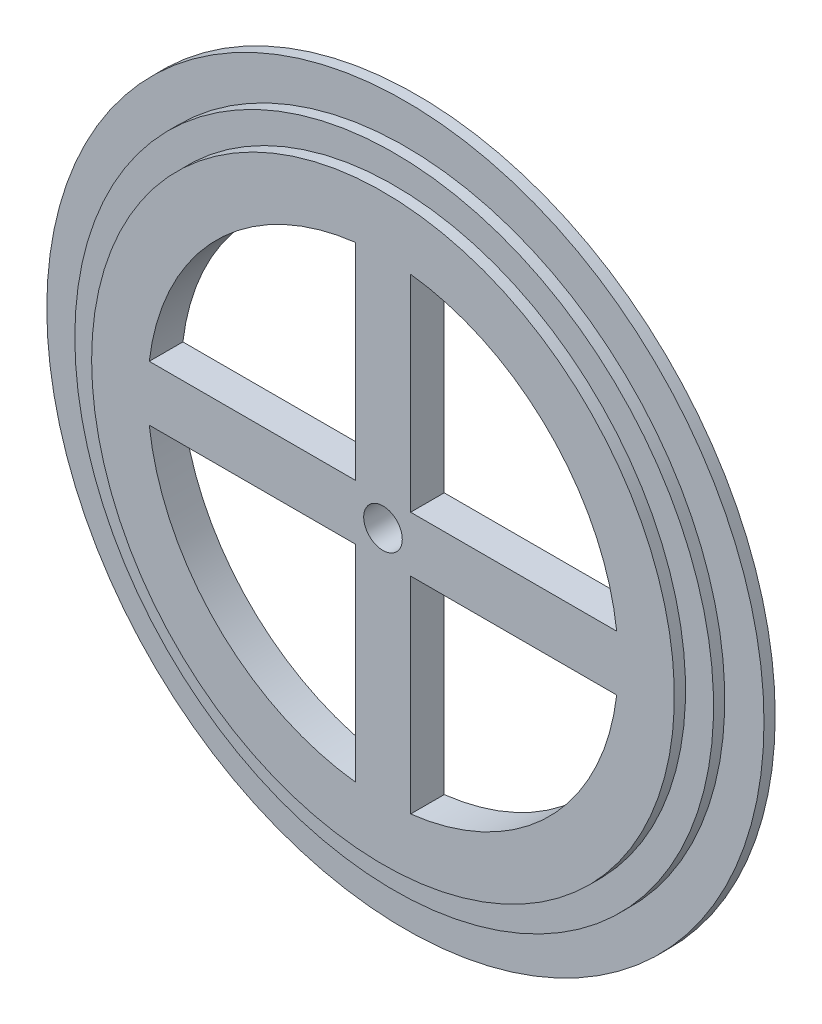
ISO-10303-21;
HEADER;
FILE_DESCRIPTION(('STEP AP214'),'2;1');
FILE_NAME('part.step','',(''),(''),'','','');
FILE_SCHEMA(('AUTOMOTIVE_DESIGN { 1 0 10303 214 1 1 1 1 }'));
ENDSEC;
DATA;
#1=APPLICATION_CONTEXT('core data for automotive mechanical design processes');
#2=APPLICATION_PROTOCOL_DEFINITION('international standard','automotive_design',2000,#1);
#3=PRODUCT_CONTEXT('',#1,'mechanical');
#4=PRODUCT('Part','Part','',(#3));
#5=PRODUCT_RELATED_PRODUCT_CATEGORY('part','',(#4));
#6=PRODUCT_DEFINITION_FORMATION('','',#4);
#7=PRODUCT_DEFINITION_CONTEXT('part definition',#1,'design');
#8=PRODUCT_DEFINITION('design','',#6,#7);
#9=PRODUCT_DEFINITION_SHAPE('','',#8);
#10=(LENGTH_UNIT() NAMED_UNIT(*) SI_UNIT(.MILLI.,.METRE.));
#11=(NAMED_UNIT(*) PLANE_ANGLE_UNIT() SI_UNIT($,.RADIAN.));
#12=(NAMED_UNIT(*) SI_UNIT($,.STERADIAN.) SOLID_ANGLE_UNIT());
#13=UNCERTAINTY_MEASURE_WITH_UNIT(LENGTH_MEASURE(1.E-05),#10,'distance_accuracy_value','');
#14=(GEOMETRIC_REPRESENTATION_CONTEXT(3) GLOBAL_UNCERTAINTY_ASSIGNED_CONTEXT((#13)) GLOBAL_UNIT_ASSIGNED_CONTEXT((#10,
#11,#12)) REPRESENTATION_CONTEXT('',''));
#15=CARTESIAN_POINT('',(0.,0.,0.));
#16=DIRECTION('',(0.,0.,1.));
#17=DIRECTION('',(1.,0.,0.));
#18=AXIS2_PLACEMENT_3D('',#15,#16,#17);
#19=CARTESIAN_POINT('',(0.,0.,0.));
#20=DIRECTION('',(0.,0.,1.));
#21=DIRECTION('',(1.,0.,0.));
#22=AXIS2_PLACEMENT_3D('',#19,#20,#21);
#23=PLANE('',#22);
#24=CARTESIAN_POINT('',(0.,0.,0.));
#25=DIRECTION('',(0.,0.,1.));
#26=DIRECTION('',(1.,0.,0.));
#27=AXIS2_PLACEMENT_3D('',#24,#25,#26);
#28=CIRCLE('',#27,5.46570251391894);
#29=CARTESIAN_POINT('',(5.46570251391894,0.,0.));
#30=VERTEX_POINT('',#29);
#31=EDGE_CURVE('E205',#30,#30,#28,.T.);
#32=ORIENTED_EDGE('',*,*,#31,.F.);
#33=EDGE_LOOP('',(#32));
#34=FACE_BOUND('',#33,.T.);
#35=DIRECTION('',(-1.,0.,0.));
#36=VECTOR('',#35,1.);
#37=CARTESIAN_POINT('',(0.,-7.82986361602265,0.));
#38=LINE('',#37,#36);
#39=CARTESIAN_POINT('',(-7.82986361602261,-7.82986361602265,0.));
#40=VERTEX_POINT('',#39);
#41=CARTESIAN_POINT('',(-66.2136606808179,-7.82986361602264,0.));
#42=VERTEX_POINT('',#41);
#43=EDGE_CURVE('E49',#40,#42,#38,.T.);
#44=ORIENTED_EDGE('',*,*,#43,.F.);
#45=DIRECTION('',(0.,1.,0.));
#46=VECTOR('',#45,1.);
#47=CARTESIAN_POINT('',(-7.82986361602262,0.,0.));
#48=LINE('',#47,#46);
#49=CARTESIAN_POINT('',(-7.8298636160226,-66.2136606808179,0.));
#50=VERTEX_POINT('',#49);
#51=EDGE_CURVE('E185',#50,#40,#48,.T.);
#52=ORIENTED_EDGE('',*,*,#51,.F.);
#53=CARTESIAN_POINT('',(0.,0.,0.));
#54=DIRECTION('',(0.,0.,1.));
#55=DIRECTION('',(1.,0.,0.));
#56=AXIS2_PLACEMENT_3D('',#53,#54,#55);
#57=CIRCLE('',#56,66.675);
#58=EDGE_CURVE('E193',#42,#50,#57,.T.);
#59=ORIENTED_EDGE('',*,*,#58,.F.);
#60=EDGE_LOOP('',(#44,#52,#59));
#61=FACE_BOUND('',#60,.T.);
#62=DIRECTION('',(0.,-1.,0.));
#63=VECTOR('',#62,1.);
#64=CARTESIAN_POINT('',(7.82986361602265,0.,0.));
#65=LINE('',#64,#63);
#66=CARTESIAN_POINT('',(7.82986361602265,-7.82986361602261,0.));
#67=VERTEX_POINT('',#66);
#68=CARTESIAN_POINT('',(7.82986361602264,-66.2136606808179,0.));
#69=VERTEX_POINT('',#68);
#70=EDGE_CURVE('E57',#67,#69,#65,.T.);
#71=ORIENTED_EDGE('',*,*,#70,.F.);
#72=DIRECTION('',(-1.,0.,0.));
#73=VECTOR('',#72,1.);
#74=CARTESIAN_POINT('',(0.,-7.82986361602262,0.));
#75=LINE('',#74,#73);
#76=CARTESIAN_POINT('',(66.2136606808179,-7.82986361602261,0.));
#77=VERTEX_POINT('',#76);
#78=EDGE_CURVE('E163',#77,#67,#75,.T.);
#79=ORIENTED_EDGE('',*,*,#78,.F.);
#80=CARTESIAN_POINT('',(0.,0.,0.));
#81=DIRECTION('',(0.,0.,1.));
#82=DIRECTION('',(1.,0.,0.));
#83=AXIS2_PLACEMENT_3D('',#80,#81,#82);
#84=CIRCLE('',#83,66.675);
#85=EDGE_CURVE('E171',#69,#77,#84,.T.);
#86=ORIENTED_EDGE('',*,*,#85,.F.);
#87=EDGE_LOOP('',(#71,#79,#86));
#88=FACE_BOUND('',#87,.T.);
#89=DIRECTION('',(1.,0.,0.));
#90=VECTOR('',#89,1.);
#91=CARTESIAN_POINT('',(0.,7.82986361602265,0.));
#92=LINE('',#91,#90);
#93=CARTESIAN_POINT('',(7.82986361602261,7.82986361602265,0.));
#94=VERTEX_POINT('',#93);
#95=CARTESIAN_POINT('',(66.2136606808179,7.82986361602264,0.));
#96=VERTEX_POINT('',#95);
#97=EDGE_CURVE('E130',#94,#96,#92,.T.);
#98=ORIENTED_EDGE('',*,*,#97,.F.);
#99=DIRECTION('',(0.,-1.,0.));
#100=VECTOR('',#99,1.);
#101=CARTESIAN_POINT('',(7.82986361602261,0.,0.));
#102=LINE('',#101,#100);
#103=CARTESIAN_POINT('',(7.82986361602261,66.2136606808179,0.));
#104=VERTEX_POINT('',#103);
#105=EDGE_CURVE('E145',#104,#94,#102,.T.);
#106=ORIENTED_EDGE('',*,*,#105,.F.);
#107=CARTESIAN_POINT('',(0.,0.,0.));
#108=DIRECTION('',(0.,0.,1.));
#109=DIRECTION('',(1.,0.,0.));
#110=AXIS2_PLACEMENT_3D('',#107,#108,#109);
#111=CIRCLE('',#110,66.675);
#112=EDGE_CURVE('E148',#96,#104,#111,.T.);
#113=ORIENTED_EDGE('',*,*,#112,.F.);
#114=EDGE_LOOP('',(#98,#106,#113));
#115=FACE_BOUND('',#114,.T.);
#116=DIRECTION('',(0.,1.,0.));
#117=VECTOR('',#116,1.);
#118=CARTESIAN_POINT('',(-7.82986361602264,0.,0.));
#119=LINE('',#118,#117);
#120=CARTESIAN_POINT('',(-7.82986361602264,7.82986361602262,0.));
#121=VERTEX_POINT('',#120);
#122=CARTESIAN_POINT('',(-7.82986361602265,66.2136606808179,0.));
#123=VERTEX_POINT('',#122);
#124=EDGE_CURVE('E157',#121,#123,#119,.T.);
#125=ORIENTED_EDGE('',*,*,#124,.F.);
#126=DIRECTION('',(1.,0.,0.));
#127=VECTOR('',#126,1.);
#128=CARTESIAN_POINT('',(0.,7.82986361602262,0.));
#129=LINE('',#128,#127);
#130=CARTESIAN_POINT('',(-66.2136606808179,7.8298636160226,0.));
#131=VERTEX_POINT('',#130);
#132=EDGE_CURVE('E212',#131,#121,#129,.T.);
#133=ORIENTED_EDGE('',*,*,#132,.F.);
#134=CARTESIAN_POINT('',(0.,0.,0.));
#135=DIRECTION('',(0.,0.,1.));
#136=DIRECTION('',(1.,0.,0.));
#137=AXIS2_PLACEMENT_3D('',#134,#135,#136);
#138=CIRCLE('',#137,66.675);
#139=EDGE_CURVE('E220',#123,#131,#138,.T.);
#140=ORIENTED_EDGE('',*,*,#139,.F.);
#141=EDGE_LOOP('',(#125,#133,#140));
#142=FACE_BOUND('',#141,.T.);
#143=CARTESIAN_POINT('',(0.,0.,0.));
#144=DIRECTION('',(0.,0.,-1.));
#145=DIRECTION('',(-1.,0.,0.));
#146=AXIS2_PLACEMENT_3D('',#143,#144,#145);
#147=CIRCLE('',#146,82.55);
#148=CARTESIAN_POINT('',(-82.55,0.,0.));
#149=VERTEX_POINT('',#148);
#150=EDGE_CURVE('E11',#149,#149,#147,.T.);
#151=ORIENTED_EDGE('',*,*,#150,.F.);
#152=EDGE_LOOP('',(#151));
#153=FACE_BOUND('',#152,.T.);
#154=ADVANCED_FACE('F35',(#34,#61,#88,#115,#142,#153),#23,.T.);
#155=CARTESIAN_POINT('',(0.,0.,-9.52500000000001));
#156=DIRECTION('',(0.,0.,-1.));
#157=DIRECTION('',(-1.,0.,0.));
#158=AXIS2_PLACEMENT_3D('',#155,#156,#157);
#159=CYLINDRICAL_SURFACE('',#158,82.55);
#160=ORIENTED_EDGE('',*,*,#150,.T.);
#161=EDGE_LOOP('',(#160));
#162=FACE_BOUND('',#161,.T.);
#163=CARTESIAN_POINT('',(0.,0.,-3.175));
#164=DIRECTION('',(0.,0.,-1.));
#165=DIRECTION('',(-1.,0.,0.));
#166=AXIS2_PLACEMENT_3D('',#163,#164,#165);
#167=CIRCLE('',#166,82.55);
#168=CARTESIAN_POINT('',(-82.55,0.,-3.175));
#169=VERTEX_POINT('',#168);
#170=EDGE_CURVE('E42',#169,#169,#167,.T.);
#171=ORIENTED_EDGE('',*,*,#170,.F.);
#172=EDGE_LOOP('',(#171));
#173=FACE_BOUND('',#172,.T.);
#174=ADVANCED_FACE('F248',(#162,#173),#159,.T.);
#175=CARTESIAN_POINT('',(0.,82.55,-3.175));
#176=DIRECTION('',(0.,0.,1.));
#177=DIRECTION('',(1.,0.,0.));
#178=AXIS2_PLACEMENT_3D('',#175,#176,#177);
#179=PLANE('',#178);
#180=ORIENTED_EDGE('',*,*,#170,.T.);
#181=EDGE_LOOP('',(#180));
#182=FACE_BOUND('',#181,.T.);
#183=CARTESIAN_POINT('',(0.,0.,-3.175));
#184=DIRECTION('',(0.,0.,-1.));
#185=DIRECTION('',(-1.,0.,0.));
#186=AXIS2_PLACEMENT_3D('',#183,#184,#185);
#187=CIRCLE('',#186,90.4875);
#188=CARTESIAN_POINT('',(-90.4875,0.,-3.175));
#189=VERTEX_POINT('',#188);
#190=EDGE_CURVE('E240',#189,#189,#187,.T.);
#191=ORIENTED_EDGE('',*,*,#190,.F.);
#192=EDGE_LOOP('',(#191));
#193=FACE_BOUND('',#192,.T.);
#194=ADVANCED_FACE('F245',(#182,#193),#179,.T.);
#195=CARTESIAN_POINT('',(0.,0.,-9.52500000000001));
#196=DIRECTION('',(0.,0.,-1.));
#197=DIRECTION('',(-1.,0.,0.));
#198=AXIS2_PLACEMENT_3D('',#195,#196,#197);
#199=CYLINDRICAL_SURFACE('',#198,90.4875);
#200=ORIENTED_EDGE('',*,*,#190,.T.);
#201=EDGE_LOOP('',(#200));
#202=FACE_BOUND('',#201,.T.);
#203=CARTESIAN_POINT('',(0.,0.,-6.35));
#204=DIRECTION('',(0.,0.,-1.));
#205=DIRECTION('',(-1.,0.,0.));
#206=AXIS2_PLACEMENT_3D('',#203,#204,#205);
#207=CIRCLE('',#206,90.4875);
#208=CARTESIAN_POINT('',(-90.4875,0.,-6.35));
#209=VERTEX_POINT('',#208);
#210=EDGE_CURVE('E237',#209,#209,#207,.T.);
#211=ORIENTED_EDGE('',*,*,#210,.F.);
#212=EDGE_LOOP('',(#211));
#213=FACE_BOUND('',#212,.T.);
#214=ADVANCED_FACE('F255',(#202,#213),#199,.T.);
#215=CARTESIAN_POINT('',(0.,90.4875,-6.35));
#216=DIRECTION('',(0.,0.,1.));
#217=DIRECTION('',(1.,0.,0.));
#218=AXIS2_PLACEMENT_3D('',#215,#216,#217);
#219=PLANE('',#218);
#220=ORIENTED_EDGE('',*,*,#210,.T.);
#221=EDGE_LOOP('',(#220));
#222=FACE_BOUND('',#221,.T.);
#223=CARTESIAN_POINT('',(0.,0.,-6.35));
#224=DIRECTION('',(0.,0.,-1.));
#225=DIRECTION('',(-1.,0.,0.));
#226=AXIS2_PLACEMENT_3D('',#223,#224,#225);
#227=CIRCLE('',#226,101.6);
#228=CARTESIAN_POINT('',(-101.6,0.,-6.35));
#229=VERTEX_POINT('',#228);
#230=EDGE_CURVE('E234',#229,#229,#227,.T.);
#231=ORIENTED_EDGE('',*,*,#230,.F.);
#232=EDGE_LOOP('',(#231));
#233=FACE_BOUND('',#232,.T.);
#234=ADVANCED_FACE('F261',(#222,#233),#219,.T.);
#235=CARTESIAN_POINT('',(0.,0.,-9.52500000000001));
#236=DIRECTION('',(0.,0.,-1.));
#237=DIRECTION('',(-1.,0.,0.));
#238=AXIS2_PLACEMENT_3D('',#235,#236,#237);
#239=CYLINDRICAL_SURFACE('',#238,101.6);
#240=ORIENTED_EDGE('',*,*,#230,.T.);
#241=EDGE_LOOP('',(#240));
#242=FACE_BOUND('',#241,.T.);
#243=CARTESIAN_POINT('',(0.,0.,-9.525));
#244=DIRECTION('',(0.,0.,-1.));
#245=DIRECTION('',(-1.,0.,0.));
#246=AXIS2_PLACEMENT_3D('',#243,#244,#245);
#247=CIRCLE('',#246,101.6);
#248=CARTESIAN_POINT('',(-101.6,0.,-9.525));
#249=VERTEX_POINT('',#248);
#250=EDGE_CURVE('E227',#249,#249,#247,.T.);
#251=ORIENTED_EDGE('',*,*,#250,.F.);
#252=EDGE_LOOP('',(#251));
#253=FACE_BOUND('',#252,.T.);
#254=ADVANCED_FACE('F265',(#242,#253),#239,.T.);
#255=CARTESIAN_POINT('',(0.,101.6,-9.525));
#256=DIRECTION('',(0.,0.,-1.));
#257=DIRECTION('',(-1.,0.,0.));
#258=AXIS2_PLACEMENT_3D('',#255,#256,#257);
#259=PLANE('',#258);
#260=CARTESIAN_POINT('',(0.,0.,-9.525));
#261=DIRECTION('',(0.,0.,1.));
#262=DIRECTION('',(1.,0.,0.));
#263=AXIS2_PLACEMENT_3D('',#260,#261,#262);
#264=CIRCLE('',#263,5.46570251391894);
#265=CARTESIAN_POINT('',(5.46570251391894,0.,-9.525));
#266=VERTEX_POINT('',#265);
#267=EDGE_CURVE('E194',#266,#266,#264,.T.);
#268=ORIENTED_EDGE('',*,*,#267,.T.);
#269=EDGE_LOOP('',(#268));
#270=FACE_BOUND('',#269,.T.);
#271=DIRECTION('',(-1.,0.,0.));
#272=VECTOR('',#271,1.);
#273=CARTESIAN_POINT('',(0.,-7.82986361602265,-9.525));
#274=LINE('',#273,#272);
#275=CARTESIAN_POINT('',(-7.82986361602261,-7.82986361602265,-9.525));
#276=VERTEX_POINT('',#275);
#277=CARTESIAN_POINT('',(-66.2136606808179,-7.82986361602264,-9.525));
#278=VERTEX_POINT('',#277);
#279=EDGE_CURVE('E181',#276,#278,#274,.T.);
#280=ORIENTED_EDGE('',*,*,#279,.T.);
#281=CARTESIAN_POINT('',(0.,0.,-9.525));
#282=DIRECTION('',(0.,0.,1.));
#283=DIRECTION('',(1.,0.,0.));
#284=AXIS2_PLACEMENT_3D('',#281,#282,#283);
#285=CIRCLE('',#284,66.675);
#286=CARTESIAN_POINT('',(-7.8298636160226,-66.2136606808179,-9.525));
#287=VERTEX_POINT('',#286);
#288=EDGE_CURVE('E184',#278,#287,#285,.T.);
#289=ORIENTED_EDGE('',*,*,#288,.T.);
#290=DIRECTION('',(0.,1.,0.));
#291=VECTOR('',#290,1.);
#292=CARTESIAN_POINT('',(-7.82986361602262,0.,-9.525));
#293=LINE('',#292,#291);
#294=EDGE_CURVE('E188',#287,#276,#293,.T.);
#295=ORIENTED_EDGE('',*,*,#294,.T.);
#296=EDGE_LOOP('',(#280,#289,#295));
#297=FACE_BOUND('',#296,.T.);
#298=DIRECTION('',(0.,-1.,0.));
#299=VECTOR('',#298,1.);
#300=CARTESIAN_POINT('',(7.82986361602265,0.,-9.525));
#301=LINE('',#300,#299);
#302=CARTESIAN_POINT('',(7.82986361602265,-7.82986361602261,-9.525));
#303=VERTEX_POINT('',#302);
#304=CARTESIAN_POINT('',(7.82986361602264,-66.2136606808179,-9.525));
#305=VERTEX_POINT('',#304);
#306=EDGE_CURVE('E159',#303,#305,#301,.T.);
#307=ORIENTED_EDGE('',*,*,#306,.T.);
#308=CARTESIAN_POINT('',(0.,0.,-9.525));
#309=DIRECTION('',(0.,0.,1.));
#310=DIRECTION('',(1.,0.,0.));
#311=AXIS2_PLACEMENT_3D('',#308,#309,#310);
#312=CIRCLE('',#311,66.675);
#313=CARTESIAN_POINT('',(66.2136606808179,-7.82986361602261,-9.525));
#314=VERTEX_POINT('',#313);
#315=EDGE_CURVE('E162',#305,#314,#312,.T.);
#316=ORIENTED_EDGE('',*,*,#315,.T.);
#317=DIRECTION('',(-1.,0.,0.));
#318=VECTOR('',#317,1.);
#319=CARTESIAN_POINT('',(0.,-7.82986361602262,-9.525));
#320=LINE('',#319,#318);
#321=EDGE_CURVE('E166',#314,#303,#320,.T.);
#322=ORIENTED_EDGE('',*,*,#321,.T.);
#323=EDGE_LOOP('',(#307,#316,#322));
#324=FACE_BOUND('',#323,.T.);
#325=DIRECTION('',(1.,0.,0.));
#326=VECTOR('',#325,1.);
#327=CARTESIAN_POINT('',(0.,7.82986361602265,-9.525));
#328=LINE('',#327,#326);
#329=CARTESIAN_POINT('',(7.82986361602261,7.82986361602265,-9.525));
#330=VERTEX_POINT('',#329);
#331=CARTESIAN_POINT('',(66.2136606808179,7.82986361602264,-9.525));
#332=VERTEX_POINT('',#331);
#333=EDGE_CURVE('E127',#330,#332,#328,.T.);
#334=ORIENTED_EDGE('',*,*,#333,.T.);
#335=CARTESIAN_POINT('',(0.,0.,-9.525));
#336=DIRECTION('',(0.,0.,1.));
#337=DIRECTION('',(1.,0.,0.));
#338=AXIS2_PLACEMENT_3D('',#335,#336,#337);
#339=CIRCLE('',#338,66.675);
#340=CARTESIAN_POINT('',(7.82986361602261,66.2136606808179,-9.525));
#341=VERTEX_POINT('',#340);
#342=EDGE_CURVE('E139',#332,#341,#339,.T.);
#343=ORIENTED_EDGE('',*,*,#342,.T.);
#344=DIRECTION('',(0.,-1.,0.));
#345=VECTOR('',#344,1.);
#346=CARTESIAN_POINT('',(7.82986361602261,0.,-9.525));
#347=LINE('',#346,#345);
#348=EDGE_CURVE('E135',#341,#330,#347,.T.);
#349=ORIENTED_EDGE('',*,*,#348,.T.);
#350=EDGE_LOOP('',(#334,#343,#349));
#351=FACE_BOUND('',#350,.T.);
#352=DIRECTION('',(0.,1.,0.));
#353=VECTOR('',#352,1.);
#354=CARTESIAN_POINT('',(-7.82986361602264,0.,-9.525));
#355=LINE('',#354,#353);
#356=CARTESIAN_POINT('',(-7.82986361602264,7.82986361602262,-9.525));
#357=VERTEX_POINT('',#356);
#358=CARTESIAN_POINT('',(-7.82986361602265,66.2136606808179,-9.525));
#359=VERTEX_POINT('',#358);
#360=EDGE_CURVE('E208',#357,#359,#355,.T.);
#361=ORIENTED_EDGE('',*,*,#360,.T.);
#362=CARTESIAN_POINT('',(0.,0.,-9.525));
#363=DIRECTION('',(0.,0.,1.));
#364=DIRECTION('',(1.,0.,0.));
#365=AXIS2_PLACEMENT_3D('',#362,#363,#364);
#366=CIRCLE('',#365,66.675);
#367=CARTESIAN_POINT('',(-66.2136606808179,7.8298636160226,-9.525));
#368=VERTEX_POINT('',#367);
#369=EDGE_CURVE('E211',#359,#368,#366,.T.);
#370=ORIENTED_EDGE('',*,*,#369,.T.);
#371=DIRECTION('',(1.,0.,0.));
#372=VECTOR('',#371,1.);
#373=CARTESIAN_POINT('',(0.,7.82986361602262,-9.525));
#374=LINE('',#373,#372);
#375=EDGE_CURVE('E215',#368,#357,#374,.T.);
#376=ORIENTED_EDGE('',*,*,#375,.T.);
#377=EDGE_LOOP('',(#361,#370,#376));
#378=FACE_BOUND('',#377,.T.);
#379=ORIENTED_EDGE('',*,*,#250,.T.);
#380=EDGE_LOOP('',(#379));
#381=FACE_BOUND('',#380,.T.);
#382=ADVANCED_FACE('F143',(#270,#297,#324,#351,#378,#381),#259,.T.);
#383=CARTESIAN_POINT('',(-7.82986361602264,0.,-9.525));
#384=DIRECTION('',(1.,0.,0.));
#385=DIRECTION('',(0.,1.,0.));
#386=AXIS2_PLACEMENT_3D('',#383,#384,#385);
#387=PLANE('',#386);
#388=ORIENTED_EDGE('',*,*,#124,.T.);
#389=DIRECTION('',(0.,0.,1.));
#390=VECTOR('',#389,1.);
#391=CARTESIAN_POINT('',(-7.82986361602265,66.2136606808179,-9.525));
#392=LINE('',#391,#390);
#393=EDGE_CURVE('E218',#359,#123,#392,.T.);
#394=ORIENTED_EDGE('',*,*,#393,.F.);
#395=ORIENTED_EDGE('',*,*,#360,.F.);
#396=DIRECTION('',(0.,0.,1.));
#397=VECTOR('',#396,1.);
#398=CARTESIAN_POINT('',(-7.82986361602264,7.82986361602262,-9.525));
#399=LINE('',#398,#397);
#400=EDGE_CURVE('E225',#357,#121,#399,.T.);
#401=ORIENTED_EDGE('',*,*,#400,.T.);
#402=EDGE_LOOP('',(#388,#394,#395,#401));
#403=FACE_BOUND('',#402,.T.);
#404=ADVANCED_FACE('F272',(#403),#387,.F.);
#405=CARTESIAN_POINT('',(0.,7.82986361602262,-9.525));
#406=DIRECTION('',(0.,-1.,0.));
#407=DIRECTION('',(1.,0.,0.));
#408=AXIS2_PLACEMENT_3D('',#405,#406,#407);
#409=PLANE('',#408);
#410=ORIENTED_EDGE('',*,*,#132,.T.);
#411=ORIENTED_EDGE('',*,*,#400,.F.);
#412=ORIENTED_EDGE('',*,*,#375,.F.);
#413=DIRECTION('',(0.,0.,1.));
#414=VECTOR('',#413,1.);
#415=CARTESIAN_POINT('',(-66.2136606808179,7.8298636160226,-9.525));
#416=LINE('',#415,#414);
#417=EDGE_CURVE('E228',#368,#131,#416,.T.);
#418=ORIENTED_EDGE('',*,*,#417,.T.);
#419=EDGE_LOOP('',(#410,#411,#412,#418));
#420=FACE_BOUND('',#419,.T.);
#421=ADVANCED_FACE('F276',(#420),#409,.F.);
#422=CARTESIAN_POINT('',(0.,0.,-9.525));
#423=DIRECTION('',(0.,0.,1.));
#424=DIRECTION('',(1.,0.,0.));
#425=AXIS2_PLACEMENT_3D('',#422,#423,#424);
#426=CYLINDRICAL_SURFACE('',#425,66.675);
#427=ORIENTED_EDGE('',*,*,#139,.T.);
#428=ORIENTED_EDGE('',*,*,#417,.F.);
#429=ORIENTED_EDGE('',*,*,#369,.F.);
#430=ORIENTED_EDGE('',*,*,#393,.T.);
#431=EDGE_LOOP('',(#427,#428,#429,#430));
#432=FACE_BOUND('',#431,.T.);
#433=ADVANCED_FACE('F278',(#432),#426,.F.);
#434=CARTESIAN_POINT('',(0.,7.82986361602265,-9.525));
#435=DIRECTION('',(0.,-1.,0.));
#436=DIRECTION('',(1.,0.,0.));
#437=AXIS2_PLACEMENT_3D('',#434,#435,#436);
#438=PLANE('',#437);
#439=ORIENTED_EDGE('',*,*,#97,.T.);
#440=DIRECTION('',(0.,0.,1.));
#441=VECTOR('',#440,1.);
#442=CARTESIAN_POINT('',(66.2136606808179,7.82986361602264,-9.525));
#443=LINE('',#442,#441);
#444=EDGE_CURVE('E123',#332,#96,#443,.T.);
#445=ORIENTED_EDGE('',*,*,#444,.F.);
#446=ORIENTED_EDGE('',*,*,#333,.F.);
#447=DIRECTION('',(0.,0.,1.));
#448=VECTOR('',#447,1.);
#449=CARTESIAN_POINT('',(7.82986361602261,7.82986361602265,-9.525));
#450=LINE('',#449,#448);
#451=EDGE_CURVE('E155',#330,#94,#450,.T.);
#452=ORIENTED_EDGE('',*,*,#451,.T.);
#453=EDGE_LOOP('',(#439,#445,#446,#452));
#454=FACE_BOUND('',#453,.T.);
#455=ADVANCED_FACE('F125',(#454),#438,.F.);
#456=CARTESIAN_POINT('',(7.82986361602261,0.,-9.525));
#457=DIRECTION('',(-1.,0.,0.));
#458=DIRECTION('',(0.,-1.,0.));
#459=AXIS2_PLACEMENT_3D('',#456,#457,#458);
#460=PLANE('',#459);
#461=ORIENTED_EDGE('',*,*,#105,.T.);
#462=ORIENTED_EDGE('',*,*,#451,.F.);
#463=ORIENTED_EDGE('',*,*,#348,.F.);
#464=DIRECTION('',(0.,0.,1.));
#465=VECTOR('',#464,1.);
#466=CARTESIAN_POINT('',(7.82986361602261,66.2136606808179,-9.525));
#467=LINE('',#466,#465);
#468=EDGE_CURVE('E134',#341,#104,#467,.T.);
#469=ORIENTED_EDGE('',*,*,#468,.T.);
#470=EDGE_LOOP('',(#461,#462,#463,#469));
#471=FACE_BOUND('',#470,.T.);
#472=ADVANCED_FACE('F313',(#471),#460,.F.);
#473=CARTESIAN_POINT('',(0.,0.,-9.525));
#474=DIRECTION('',(0.,0.,1.));
#475=DIRECTION('',(1.,0.,0.));
#476=AXIS2_PLACEMENT_3D('',#473,#474,#475);
#477=CYLINDRICAL_SURFACE('',#476,66.675);
#478=ORIENTED_EDGE('',*,*,#112,.T.);
#479=ORIENTED_EDGE('',*,*,#468,.F.);
#480=ORIENTED_EDGE('',*,*,#342,.F.);
#481=ORIENTED_EDGE('',*,*,#444,.T.);
#482=EDGE_LOOP('',(#478,#479,#480,#481));
#483=FACE_BOUND('',#482,.T.);
#484=ADVANCED_FACE('F140',(#483),#477,.F.);
#485=CARTESIAN_POINT('',(7.82986361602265,0.,-9.525));
#486=DIRECTION('',(-1.,0.,0.));
#487=DIRECTION('',(0.,-1.,0.));
#488=AXIS2_PLACEMENT_3D('',#485,#486,#487);
#489=PLANE('',#488);
#490=ORIENTED_EDGE('',*,*,#70,.T.);
#491=DIRECTION('',(0.,0.,1.));
#492=VECTOR('',#491,1.);
#493=CARTESIAN_POINT('',(7.82986361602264,-66.2136606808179,-9.525));
#494=LINE('',#493,#492);
#495=EDGE_CURVE('E169',#305,#69,#494,.T.);
#496=ORIENTED_EDGE('',*,*,#495,.F.);
#497=ORIENTED_EDGE('',*,*,#306,.F.);
#498=DIRECTION('',(0.,0.,1.));
#499=VECTOR('',#498,1.);
#500=CARTESIAN_POINT('',(7.82986361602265,-7.82986361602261,-9.525));
#501=LINE('',#500,#499);
#502=EDGE_CURVE('E153',#303,#67,#501,.T.);
#503=ORIENTED_EDGE('',*,*,#502,.T.);
#504=EDGE_LOOP('',(#490,#496,#497,#503));
#505=FACE_BOUND('',#504,.T.);
#506=ADVANCED_FACE('F301',(#505),#489,.F.);
#507=CARTESIAN_POINT('',(0.,-7.82986361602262,-9.525));
#508=DIRECTION('',(0.,1.,0.));
#509=DIRECTION('',(-1.,0.,0.));
#510=AXIS2_PLACEMENT_3D('',#507,#508,#509);
#511=PLANE('',#510);
#512=ORIENTED_EDGE('',*,*,#78,.T.);
#513=ORIENTED_EDGE('',*,*,#502,.F.);
#514=ORIENTED_EDGE('',*,*,#321,.F.);
#515=DIRECTION('',(0.,0.,1.));
#516=VECTOR('',#515,1.);
#517=CARTESIAN_POINT('',(66.2136606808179,-7.82986361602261,-9.525));
#518=LINE('',#517,#516);
#519=EDGE_CURVE('E178',#314,#77,#518,.T.);
#520=ORIENTED_EDGE('',*,*,#519,.T.);
#521=EDGE_LOOP('',(#512,#513,#514,#520));
#522=FACE_BOUND('',#521,.T.);
#523=ADVANCED_FACE('F304',(#522),#511,.F.);
#524=CARTESIAN_POINT('',(0.,0.,-9.525));
#525=DIRECTION('',(0.,0.,1.));
#526=DIRECTION('',(1.,0.,0.));
#527=AXIS2_PLACEMENT_3D('',#524,#525,#526);
#528=CYLINDRICAL_SURFACE('',#527,66.675);
#529=ORIENTED_EDGE('',*,*,#85,.T.);
#530=ORIENTED_EDGE('',*,*,#519,.F.);
#531=ORIENTED_EDGE('',*,*,#315,.F.);
#532=ORIENTED_EDGE('',*,*,#495,.T.);
#533=EDGE_LOOP('',(#529,#530,#531,#532));
#534=FACE_BOUND('',#533,.T.);
#535=ADVANCED_FACE('F294',(#534),#528,.F.);
#536=CARTESIAN_POINT('',(0.,-7.82986361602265,-9.525));
#537=DIRECTION('',(0.,1.,0.));
#538=DIRECTION('',(-1.,0.,0.));
#539=AXIS2_PLACEMENT_3D('',#536,#537,#538);
#540=PLANE('',#539);
#541=ORIENTED_EDGE('',*,*,#43,.T.);
#542=DIRECTION('',(0.,0.,1.));
#543=VECTOR('',#542,1.);
#544=CARTESIAN_POINT('',(-66.2136606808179,-7.82986361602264,-9.525));
#545=LINE('',#544,#543);
#546=EDGE_CURVE('E191',#278,#42,#545,.T.);
#547=ORIENTED_EDGE('',*,*,#546,.F.);
#548=ORIENTED_EDGE('',*,*,#279,.F.);
#549=DIRECTION('',(0.,0.,1.));
#550=VECTOR('',#549,1.);
#551=CARTESIAN_POINT('',(-7.82986361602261,-7.82986361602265,-9.525));
#552=LINE('',#551,#550);
#553=EDGE_CURVE('E172',#276,#40,#552,.T.);
#554=ORIENTED_EDGE('',*,*,#553,.T.);
#555=EDGE_LOOP('',(#541,#547,#548,#554));
#556=FACE_BOUND('',#555,.T.);
#557=ADVANCED_FACE('F290',(#556),#540,.F.);
#558=CARTESIAN_POINT('',(-7.82986361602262,0.,-9.525));
#559=DIRECTION('',(1.,0.,0.));
#560=DIRECTION('',(0.,1.,0.));
#561=AXIS2_PLACEMENT_3D('',#558,#559,#560);
#562=PLANE('',#561);
#563=ORIENTED_EDGE('',*,*,#51,.T.);
#564=ORIENTED_EDGE('',*,*,#553,.F.);
#565=ORIENTED_EDGE('',*,*,#294,.F.);
#566=DIRECTION('',(0.,0.,1.));
#567=VECTOR('',#566,1.);
#568=CARTESIAN_POINT('',(-7.8298636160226,-66.2136606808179,-9.525));
#569=LINE('',#568,#567);
#570=EDGE_CURVE('E200',#287,#50,#569,.T.);
#571=ORIENTED_EDGE('',*,*,#570,.T.);
#572=EDGE_LOOP('',(#563,#564,#565,#571));
#573=FACE_BOUND('',#572,.T.);
#574=ADVANCED_FACE('F293',(#573),#562,.F.);
#575=CARTESIAN_POINT('',(0.,0.,-9.525));
#576=DIRECTION('',(0.,0.,1.));
#577=DIRECTION('',(1.,0.,0.));
#578=AXIS2_PLACEMENT_3D('',#575,#576,#577);
#579=CYLINDRICAL_SURFACE('',#578,66.675);
#580=ORIENTED_EDGE('',*,*,#58,.T.);
#581=ORIENTED_EDGE('',*,*,#570,.F.);
#582=ORIENTED_EDGE('',*,*,#288,.F.);
#583=ORIENTED_EDGE('',*,*,#546,.T.);
#584=EDGE_LOOP('',(#580,#581,#582,#583));
#585=FACE_BOUND('',#584,.T.);
#586=ADVANCED_FACE('F288',(#585),#579,.F.);
#587=CARTESIAN_POINT('',(0.,0.,-9.525));
#588=DIRECTION('',(0.,0.,1.));
#589=DIRECTION('',(1.,0.,0.));
#590=AXIS2_PLACEMENT_3D('',#587,#588,#589);
#591=CYLINDRICAL_SURFACE('',#590,5.46570251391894);
#592=ORIENTED_EDGE('',*,*,#267,.F.);
#593=EDGE_LOOP('',(#592));
#594=FACE_BOUND('',#593,.T.);
#595=ORIENTED_EDGE('',*,*,#31,.T.);
#596=EDGE_LOOP('',(#595));
#597=FACE_BOUND('',#596,.T.);
#598=ADVANCED_FACE('F285',(#594,#597),#591,.F.);
#599=CLOSED_SHELL('',(#154,#174,#194,#214,#234,#254,#382,#404,#421,#433,#455,#472,#484,#506,
#523,#535,#557,#574,#586,#598));
#600=MANIFOLD_SOLID_BREP('B2',#599);
#601=ADVANCED_BREP_SHAPE_REPRESENTATION('',(#18,#600),#14);
#602=SHAPE_DEFINITION_REPRESENTATION(#9,#601);
ENDSEC;
END-ISO-10303-21;
